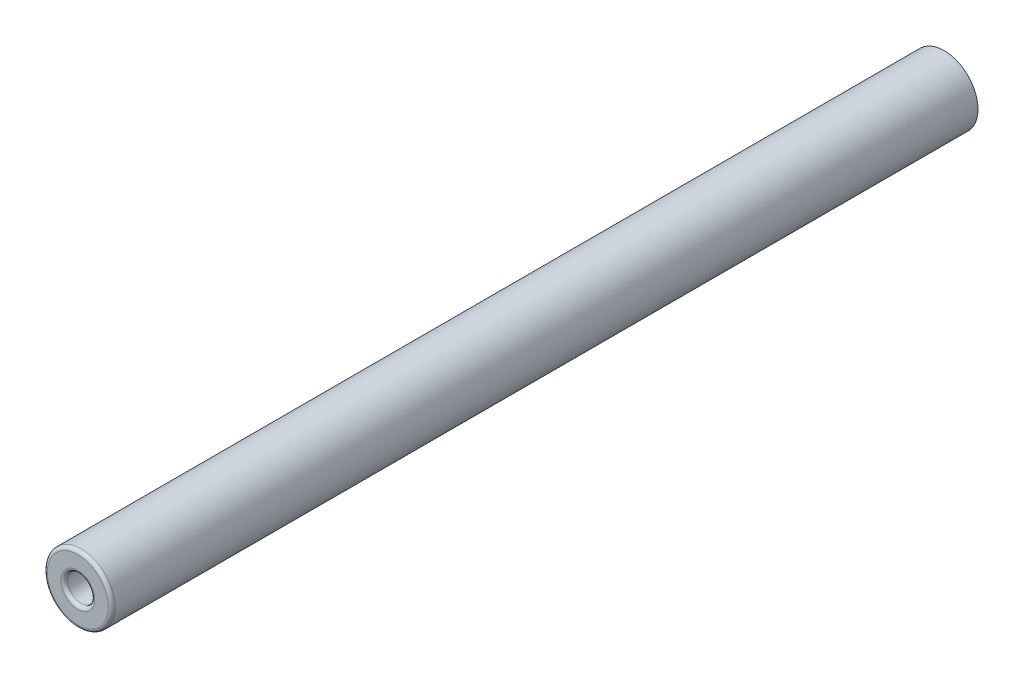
from build123d import *

# Parameters (mm, degrees)
SKETCH1_R           = 2.5
BOSS_EXTRUDE1_DEPTH = 64
SKETCH2_R           = 1
CUT_EXTRUDE1_DEPTH  = 10
FILLET1_R           = 0.25


with BuildPart() as part:
    # Sketch1 → Boss-Extrude1 (new body)
    with BuildSketch(Plane.XY):
        Circle(SKETCH1_R)
    extrude(amount=BOSS_EXTRUDE1_DEPTH)

    # Sketch2 → Cut-Extrude1 (cut)
    with BuildSketch(Plane.XY.offset(64)):
        Circle(SKETCH2_R)
    extrude(amount=-CUT_EXTRUDE1_DEPTH, mode=Mode.SUBTRACT)

    # Fillet1
    fillet1_edges = [part.edges().sort_by_distance(p)[0] for p in [
        (-2.5, 0, 64),
        (-1, 0, 64),
    ]]
    fillet(fillet1_edges, radius=FILLET1_R)


solid = part.part
